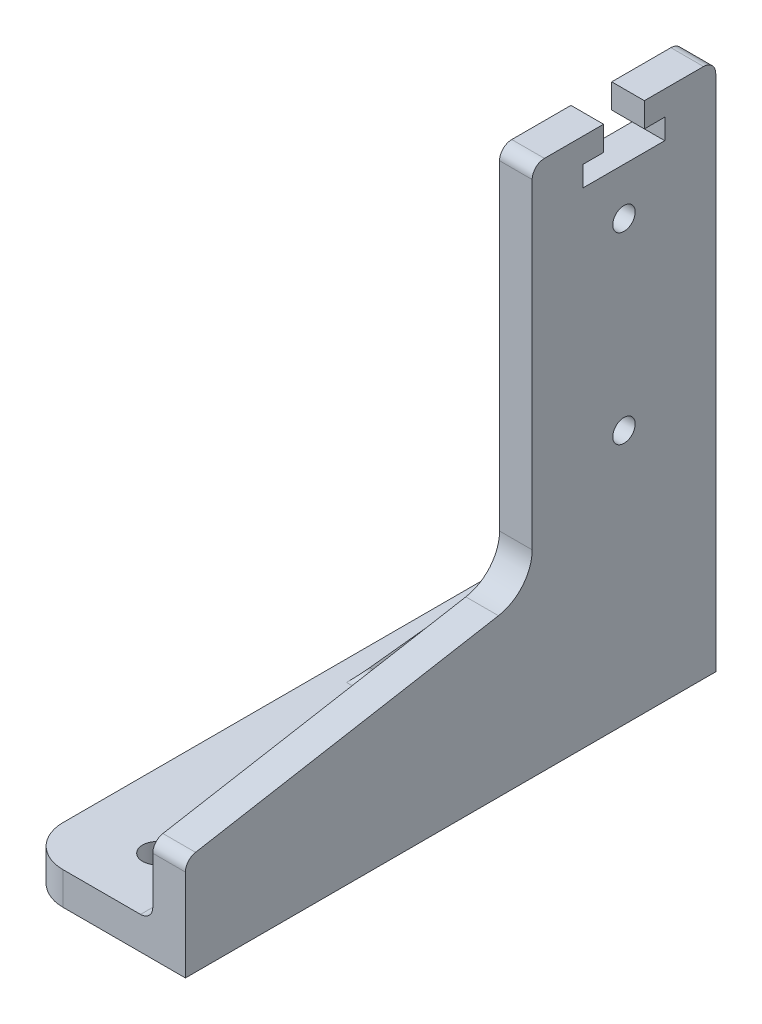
from build123d import *

# Parameters (mm, degrees)
BOSS_EXTRU_1_DEPTH      = 65
ESQUISSE2_R             = 2.75
ENL_V_MAT_EXTRU_1_DEPTH = 149.825401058
ESQUISSE3_R             = 3.5
ENL_V_MAT_EXTRU_2_DEPTH = 144.906219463
ENL_V_MAT_EXTRU_3_DEPTH = 149.825401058
ENL_V_MAT_EXTRU_4_DEPTH = 149.825401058
CONG_2_R                = 10
NERVURE2_REACH          = 159.797
ESQUISSE5_WALL_W        = 357.955548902
ESQUISSE5_WALL_H        = 5
CONG_1_R                = 3


with BuildPart() as part:
    # Esquisse1 → Boss.-Extru.1 (new, symmetric)
    with BuildSketch(Plane.XY):
        Polygon((0, 0), (0, 130), (-8, 130), (-8, 8), (-40, 8), (-40, 0), align=None)
    extrude(amount=BOSS_EXTRU_1_DEPTH, both=True)

    # Esquisse2 → Enl_v. mat.-Extru.1 (cut, through all)
    with BuildSketch(Plane.ZY.offset(8)):
        with Locations(Location((-42.5, 107.5, 0), (0, 0, 270))):
            Circle(ESQUISSE2_R)
        with Locations(Location((-42.5, 62.5, 0), (0, 0, 270))):
            Circle(ESQUISSE2_R)
    extrude(amount=-ENL_V_MAT_EXTRU_1_DEPTH, mode=Mode.SUBTRACT)

    # Esquisse3 → Enl_v. mat.-Extru.2 (cut, through all)
    with BuildSketch(Plane(origin=(0, 8, 0), x_dir=(1, 0, 0), z_dir=(0, 1, 0))):
        with Locations(Location((-22, 50, 0), (0, 0, 180))):
            Circle(ESQUISSE3_R)
        with Locations(Location((-22, -50, 0), (0, 0, 180))):
            Circle(ESQUISSE3_R)
    extrude(amount=-ENL_V_MAT_EXTRU_2_DEPTH, mode=Mode.SUBTRACT)

    # Esquisse4 → Enl_v. mat.-Extru.3 (cut, through all)
    with BuildSketch(Plane.ZY.offset(8)):
        Polygon((-20, 130), (65, 130), (65, 25), (-20, 40), align=None)
    extrude(amount=-ENL_V_MAT_EXTRU_3_DEPTH, mode=Mode.SUBTRACT)

    # Esquisse6 → Enl_v. mat.-Extru.4 (cut, through all)
    with BuildSketch(Plane.ZY.offset(8)):
        Polygon((-47.5, 130), (-37.5, 130), (-37.5, 124), (-32.5, 124), (-32.5, 119), (-52.5, 119), (-52.5, 124), (-47.5, 124), align=None)
    extrude(amount=-ENL_V_MAT_EXTRU_4_DEPTH, mode=Mode.SUBTRACT)

    # Cong_2
    cong_2_edges = [part.edges().sort_by_distance(p)[0] for p in [
        (-40, 4, 65),
        (-4, 40, -20),
        (-40, 4, -65),
    ]]
    fillet(cong_2_edges, radius=CONG_2_R)

    # Esquisse5 wall → Nervure2 (add, up to next)
    with BuildSketch(Plane(origin=(-21.5, 23, -15), x_dir=(0.668964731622, 0.743294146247, 0), z_dir=(-0.743294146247, 0.668964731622, 0)), mode=Mode.PRIVATE) as nervure2_sk1:
        Rectangle(ESQUISSE5_WALL_W, ESQUISSE5_WALL_H)
    nervure2_tool1 = extrude(nervure2_sk1.sketch, amount=-NERVURE2_REACH, mode=Mode.PRIVATE) - part.part
    add(nervure2_tool1.solids().sort_by_distance((-21.5, 23, -15))[0])

    # Cong_1
    cong_1_edges = [part.edges().sort_by_distance(p)[0] for p in [
        (-8, 8, -41.25),
        (-8, 8, 26.25),
        (-8, 23, -17.5),
        (-21.5, 8, -17.5),
        (-8, 23, -12.5),
        (-21.5, 8, -12.5),
        (-4, 130, -20),
        (-4, 25, 65),
        (-4, 130, -65),
    ]]
    fillet(cong_1_edges, radius=CONG_1_R)


solid = part.part
